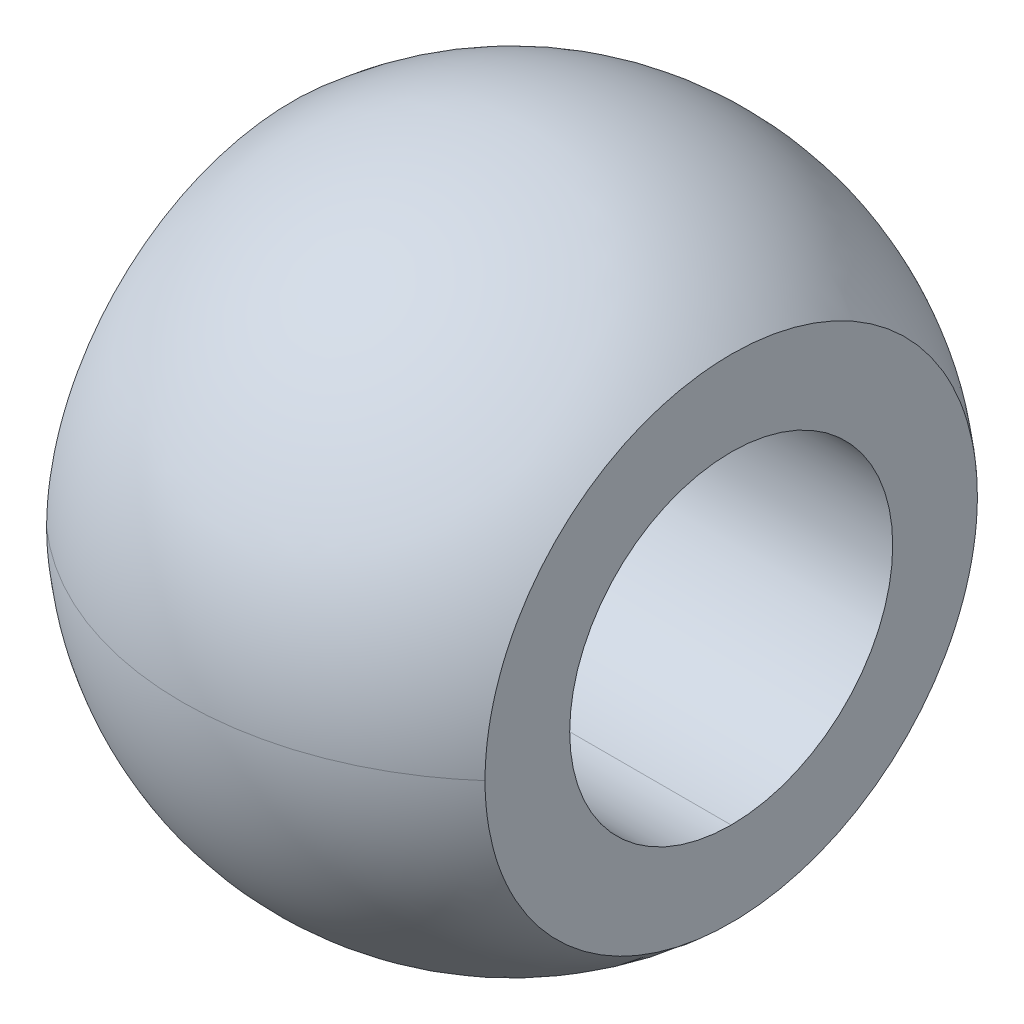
ISO-10303-21;
HEADER;
FILE_DESCRIPTION(('STEP AP214'),'2;1');
FILE_NAME('part.step','',(''),(''),'','','');
FILE_SCHEMA(('AUTOMOTIVE_DESIGN { 1 0 10303 214 1 1 1 1 }'));
ENDSEC;
DATA;
#1=APPLICATION_CONTEXT('core data for automotive mechanical design processes');
#2=APPLICATION_PROTOCOL_DEFINITION('international standard','automotive_design',2000,#1);
#3=PRODUCT_CONTEXT('',#1,'mechanical');
#4=PRODUCT('Part','Part','',(#3));
#5=PRODUCT_RELATED_PRODUCT_CATEGORY('part','',(#4));
#6=PRODUCT_DEFINITION_FORMATION('','',#4);
#7=PRODUCT_DEFINITION_CONTEXT('part definition',#1,'design');
#8=PRODUCT_DEFINITION('design','',#6,#7);
#9=PRODUCT_DEFINITION_SHAPE('','',#8);
#10=(LENGTH_UNIT() NAMED_UNIT(*) SI_UNIT(.MILLI.,.METRE.));
#11=(NAMED_UNIT(*) PLANE_ANGLE_UNIT() SI_UNIT($,.RADIAN.));
#12=(NAMED_UNIT(*) SI_UNIT($,.STERADIAN.) SOLID_ANGLE_UNIT());
#13=UNCERTAINTY_MEASURE_WITH_UNIT(LENGTH_MEASURE(1.E-05),#10,'distance_accuracy_value','');
#14=(GEOMETRIC_REPRESENTATION_CONTEXT(3) GLOBAL_UNCERTAINTY_ASSIGNED_CONTEXT((#13)) GLOBAL_UNIT_ASSIGNED_CONTEXT((#10,
#11,#12)) REPRESENTATION_CONTEXT('',''));
#15=CARTESIAN_POINT('',(0.,0.,0.));
#16=DIRECTION('',(0.,0.,1.));
#17=DIRECTION('',(1.,0.,0.));
#18=AXIS2_PLACEMENT_3D('',#15,#16,#17);
#19=CARTESIAN_POINT('',(0.,0.,0.));
#20=DIRECTION('',(-1.,0.,0.));
#21=DIRECTION('',(0.,0.,1.));
#22=AXIS2_PLACEMENT_3D('',#19,#20,#21);
#23=CYLINDRICAL_SURFACE('',#22,7.);
#24=CARTESIAN_POINT('',(9.5,0.,0.));
#25=DIRECTION('',(-1.,0.,0.));
#26=DIRECTION('',(0.,0.,1.));
#27=AXIS2_PLACEMENT_3D('',#24,#25,#26);
#28=CIRCLE('',#27,7.);
#29=CARTESIAN_POINT('',(9.5,7.,0.));
#30=VERTEX_POINT('',#29);
#31=CARTESIAN_POINT('',(9.5,-7.,0.));
#32=VERTEX_POINT('',#31);
#33=EDGE_CURVE('E68',#30,#32,#28,.F.);
#34=ORIENTED_EDGE('',*,*,#33,.T.);
#35=DIRECTION('',(-1.,0.,0.));
#36=VECTOR('',#35,1.);
#37=CARTESIAN_POINT('',(0.,-7.,0.));
#38=LINE('',#37,#36);
#39=CARTESIAN_POINT('',(-9.5,-7.,0.));
#40=VERTEX_POINT('',#39);
#41=EDGE_CURVE('E63',#32,#40,#38,.T.);
#42=ORIENTED_EDGE('',*,*,#41,.T.);
#43=CARTESIAN_POINT('',(-9.5,0.,0.));
#44=DIRECTION('',(-1.,0.,0.));
#45=DIRECTION('',(0.,0.,1.));
#46=AXIS2_PLACEMENT_3D('',#43,#44,#45);
#47=CIRCLE('',#46,7.);
#48=CARTESIAN_POINT('',(-9.5,7.,0.));
#49=VERTEX_POINT('',#48);
#50=EDGE_CURVE('E65',#40,#49,#47,.T.);
#51=ORIENTED_EDGE('',*,*,#50,.T.);
#52=DIRECTION('',(-1.,0.,0.));
#53=VECTOR('',#52,1.);
#54=CARTESIAN_POINT('',(0.,7.,0.));
#55=LINE('',#54,#53);
#56=EDGE_CURVE('E58',#49,#30,#55,.F.);
#57=ORIENTED_EDGE('',*,*,#56,.T.);
#58=EDGE_LOOP('',(#34,#42,#51,#57));
#59=FACE_BOUND('',#58,.T.);
#60=ADVANCED_FACE('F14',(#59),#23,.F.);
#61=CARTESIAN_POINT('',(0.,0.,0.));
#62=DIRECTION('',(-1.,0.,0.));
#63=DIRECTION('',(0.,0.,1.));
#64=AXIS2_PLACEMENT_3D('',#61,#62,#63);
#65=CYLINDRICAL_SURFACE('',#64,7.);
#66=CARTESIAN_POINT('',(-9.5,0.,0.));
#67=DIRECTION('',(-1.,0.,0.));
#68=DIRECTION('',(0.,0.,1.));
#69=AXIS2_PLACEMENT_3D('',#66,#67,#68);
#70=CIRCLE('',#69,7.);
#71=EDGE_CURVE('E17',#49,#40,#70,.T.);
#72=ORIENTED_EDGE('',*,*,#71,.T.);
#73=ORIENTED_EDGE('',*,*,#41,.F.);
#74=CARTESIAN_POINT('',(9.5,0.,0.));
#75=DIRECTION('',(-1.,0.,0.));
#76=DIRECTION('',(0.,0.,1.));
#77=AXIS2_PLACEMENT_3D('',#74,#75,#76);
#78=CIRCLE('',#77,7.);
#79=EDGE_CURVE('E154',#32,#30,#78,.F.);
#80=ORIENTED_EDGE('',*,*,#79,.T.);
#81=ORIENTED_EDGE('',*,*,#56,.F.);
#82=EDGE_LOOP('',(#72,#73,#80,#81));
#83=FACE_BOUND('',#82,.T.);
#84=ADVANCED_FACE('F71',(#83),#65,.F.);
#85=CARTESIAN_POINT('',(-9.5,28.57,28.57));
#86=DIRECTION('',(1.,0.,0.));
#87=DIRECTION('',(0.,0.,-1.));
#88=AXIS2_PLACEMENT_3D('',#85,#86,#87);
#89=PLANE('',#88);
#90=CARTESIAN_POINT('',(-9.5,0.,10.668234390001));
#91=CARTESIAN_POINT('',(-9.5,-0.300055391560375,10.6682666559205));
#92=CARTESIAN_POINT('',(-9.5,-0.600106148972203,10.6555766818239));
#93=CARTESIAN_POINT('',(-9.5,-1.19806087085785,10.6049852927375));
#94=CARTESIAN_POINT('',(-9.5,-1.49596493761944,10.5670850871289));
#95=CARTESIAN_POINT('',(-9.5,-2.08729445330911,10.4663443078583));
#96=CARTESIAN_POINT('',(-9.5,-2.38072311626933,10.4035226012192));
#97=CARTESIAN_POINT('',(-9.5,-2.96124479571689,10.2533958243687));
#98=CARTESIAN_POINT('',(-9.5,-3.24833788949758,10.1660910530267));
#99=CARTESIAN_POINT('',(-9.5,-3.81429045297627,9.9675668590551));
#100=CARTESIAN_POINT('',(-9.5,-4.09314584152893,9.85633580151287));
#101=CARTESIAN_POINT('',(-9.5,-4.64049407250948,9.61077579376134));
#102=CARTESIAN_POINT('',(-9.5,-4.90898691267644,9.47644683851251));
#103=CARTESIAN_POINT('',(-9.5,-5.43365519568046,9.1856713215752));
#104=CARTESIAN_POINT('',(-9.5,-5.6898327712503,9.02922860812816));
#105=CARTESIAN_POINT('',(-9.5,-6.18809814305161,8.69532095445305));
#106=CARTESIAN_POINT('',(-9.5,-6.43018601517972,8.51785612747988));
#107=CARTESIAN_POINT('',(-9.5,-6.89855039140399,8.14316682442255));
#108=CARTESIAN_POINT('',(-9.5,-7.12482704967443,7.94594254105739));
#109=CARTESIAN_POINT('',(-9.5,-7.5599643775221,7.53313368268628));
#110=CARTESIAN_POINT('',(-9.5,-7.76882495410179,7.31754900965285));
#111=CARTESIAN_POINT('',(-9.5,-8.16768431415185,6.86950749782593));
#112=CARTESIAN_POINT('',(-9.5,-8.35767929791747,6.63704727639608));
#113=CARTESIAN_POINT('',(-9.5,-8.71740589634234,6.15694997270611));
#114=CARTESIAN_POINT('',(-9.5,-8.8871378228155,5.90931312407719));
#115=CARTESIAN_POINT('',(-9.5,-9.205166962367,5.40056784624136));
#116=CARTESIAN_POINT('',(-9.5,-9.35345984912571,5.13945671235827));
#117=CARTESIAN_POINT('',(-9.5,-9.6275155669,4.60566885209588));
#118=CARTESIAN_POINT('',(-9.5,-9.75327830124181,4.33299207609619));
#119=CARTESIAN_POINT('',(-9.5,-9.98132585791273,3.77812983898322));
#120=CARTESIAN_POINT('',(-9.5,-10.083621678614,3.49594890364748));
#121=CARTESIAN_POINT('',(-9.5,-10.264058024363,2.92408463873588));
#122=CARTESIAN_POINT('',(-9.5,-10.342204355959,2.63440313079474));
#123=CARTESIAN_POINT('',(-9.5,-10.494451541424,1.9576995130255));
#124=CARTESIAN_POINT('',(-9.5,-10.5596179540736,1.56860910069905));
#125=CARTESIAN_POINT('',(-9.5,-10.6247801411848,0.981849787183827));
#126=CARTESIAN_POINT('',(-9.5,-10.6410696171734,0.785842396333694));
#127=CARTESIAN_POINT('',(-9.5,-10.6627954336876,0.393239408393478));
#128=CARTESIAN_POINT('',(-9.5,-10.6682324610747,0.196643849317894));
#129=CARTESIAN_POINT('',(-9.5,-10.668234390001,0.));
#130=B_SPLINE_CURVE_WITH_KNOTS('',3,(#90,#91,#92,#93,#94,#95,#96,#97,#98,#99,#100,#101,#102,
#103,#104,#105,#106,#107,#108,#109,#110,#111,#112,#113,#114,#115,#116,#117,#118,#119,#120,#121,
#122,#123,#124,#125,#126,#127,#128,#129),.UNSPECIFIED.,.F.,.F.,(4,2,2,2,2,2,2,2,2,2,2,2,2,2,2,2,
2,2,2,4),(0.,0.899891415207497,1.79973966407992,2.69890797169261,3.59806530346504,
4.49766087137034,5.39725663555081,6.29669604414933,7.19613060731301,8.09555639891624,
8.994986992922,9.89459837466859,10.7941959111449,11.6939747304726,12.5937574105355,
13.4931175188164,14.3922612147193,15.573045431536,16.162842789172,16.7526028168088),.UNSPECIFIED.);
#131=CARTESIAN_POINT('',(-9.5,0.,10.668234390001));
#132=VERTEX_POINT('',#131);
#133=CARTESIAN_POINT('',(-9.5,-10.668234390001,0.));
#134=VERTEX_POINT('',#133);
#135=EDGE_CURVE('E74',#132,#134,#130,.T.);
#136=ORIENTED_EDGE('',*,*,#135,.F.);
#137=CARTESIAN_POINT('',(-9.5,-4.17027523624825E-12,-10.668234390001));
#138=CARTESIAN_POINT('',(-9.5,0.300047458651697,-10.6682666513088));
#139=CARTESIAN_POINT('',(-9.5,0.600090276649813,-10.655577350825));
#140=CARTESIAN_POINT('',(-9.5,1.19802931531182,-10.604988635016));
#141=CARTESIAN_POINT('',(-9.5,1.49592563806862,-10.5670904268));
#142=CARTESIAN_POINT('',(-9.5,2.08725560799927,-10.4663522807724));
#143=CARTESIAN_POINT('',(-9.5,2.3806922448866,-10.4035298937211));
#144=CARTESIAN_POINT('',(-9.5,2.9612296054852,-10.2534004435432));
#145=CARTESIAN_POINT('',(-9.5,3.24833040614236,-10.1660936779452));
#146=CARTESIAN_POINT('',(-9.5,3.81429334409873,-9.96756584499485));
#147=CARTESIAN_POINT('',(-9.5,4.09315153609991,-9.85633353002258));
#148=CARTESIAN_POINT('',(-9.5,4.64050511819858,-9.61077055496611));
#149=CARTESIAN_POINT('',(-9.5,4.90900050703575,-9.4764398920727));
#150=CARTESIAN_POINT('',(-9.5,5.43366816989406,-9.18566354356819));
#151=CARTESIAN_POINT('',(-9.5,5.68984283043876,-9.02922216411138));
#152=CARTESIAN_POINT('',(-9.5,6.18810286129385,-8.69531749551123));
#153=CARTESIAN_POINT('',(-9.5,6.43018829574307,-8.51785430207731));
#154=CARTESIAN_POINT('',(-9.5,6.89855589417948,-8.14316242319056));
#155=CARTESIAN_POINT('',(-9.5,7.12483768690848,-7.94593327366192));
#156=CARTESIAN_POINT('',(-9.5,7.55998365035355,-7.53311457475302));
#157=CARTESIAN_POINT('',(-9.5,7.76884779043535,-7.31752499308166));
#158=CARTESIAN_POINT('',(-9.5,8.1677036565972,-6.86948413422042));
#159=CARTESIAN_POINT('',(-9.5,8.35769251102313,-6.63703030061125));
#160=CARTESIAN_POINT('',(-9.5,8.71741073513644,-6.15694285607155));
#161=CARTESIAN_POINT('',(-9.5,8.88714011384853,-5.90930925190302));
#162=CARTESIAN_POINT('',(-9.5,9.20512563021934,-5.40063417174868));
#163=CARTESIAN_POINT('',(-9.5,9.35338271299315,-5.13959328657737));
#164=CARTESIAN_POINT('',(-9.5,9.62737845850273,-4.60594955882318));
#165=CARTESIAN_POINT('',(-9.5,9.75311711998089,-4.3333467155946));
#166=CARTESIAN_POINT('',(-9.5,9.98117471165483,-3.77853505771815));
#167=CARTESIAN_POINT('',(-9.5,10.0834951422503,-3.49632685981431));
#168=CARTESIAN_POINT('',(-9.5,10.2639991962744,-2.9242941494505));
#169=CARTESIAN_POINT('',(-9.5,10.3421828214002,-2.63446963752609));
#170=CARTESIAN_POINT('',(-9.5,10.4738588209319,-2.04925861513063));
#171=CARTESIAN_POINT('',(-9.5,10.5273506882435,-1.75387199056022));
#172=CARTESIAN_POINT('',(-9.5,10.6092605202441,-1.15964248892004));
#173=CARTESIAN_POINT('',(-9.5,10.6376784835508,-0.860799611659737));
#174=CARTESIAN_POINT('',(-9.5,10.6692388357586,-0.261775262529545));
#175=CARTESIAN_POINT('',(-9.5,10.6723806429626,0.0384062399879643));
#176=CARTESIAN_POINT('',(-9.5,10.6533648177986,0.637966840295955));
#177=CARTESIAN_POINT('',(-9.5,10.6312071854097,0.937345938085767));
#178=CARTESIAN_POINT('',(-9.5,10.5617503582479,1.53317031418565));
#179=CARTESIAN_POINT('',(-9.5,10.5144514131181,1.82961562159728));
#180=CARTESIAN_POINT('',(-9.5,10.3950483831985,2.4174678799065));
#181=CARTESIAN_POINT('',(-9.5,10.3229442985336,2.70887483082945));
#182=CARTESIAN_POINT('',(-9.5,10.1544438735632,3.2845777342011));
#183=CARTESIAN_POINT('',(-9.5,10.0580476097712,3.56887370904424));
#184=CARTESIAN_POINT('',(-9.5,9.84164803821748,4.12833442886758));
#185=CARTESIAN_POINT('',(-9.5,9.72164473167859,4.40349917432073));
#186=CARTESIAN_POINT('',(-9.5,9.45888078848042,4.94274824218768));
#187=CARTESIAN_POINT('',(-9.5,9.31611955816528,5.20683227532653));
#188=CARTESIAN_POINT('',(-9.5,9.00885694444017,5.72203482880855));
#189=CARTESIAN_POINT('',(-9.5,8.84435555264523,5.97315334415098));
#190=CARTESIAN_POINT('',(-9.5,8.49479072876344,6.46062750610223));
#191=CARTESIAN_POINT('',(-9.5,8.30972829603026,6.69698386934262));
#192=CARTESIAN_POINT('',(-9.5,7.9203508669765,7.15326632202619));
#193=CARTESIAN_POINT('',(-9.5,7.71603590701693,7.37319244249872));
#194=CARTESIAN_POINT('',(-9.5,7.28963493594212,7.79502243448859));
#195=CARTESIAN_POINT('',(-9.5,7.06755136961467,7.99692877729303));
#196=CARTESIAN_POINT('',(-9.5,6.60716540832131,8.38131963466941));
#197=CARTESIAN_POINT('',(-9.5,6.36886289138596,8.56380400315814));
#198=CARTESIAN_POINT('',(-9.5,5.87765308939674,8.90810906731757));
#199=CARTESIAN_POINT('',(-9.5,5.62474101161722,9.06992292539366));
#200=CARTESIAN_POINT('',(-9.5,5.10619007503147,9.37166100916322));
#201=CARTESIAN_POINT('',(-9.5,4.8405516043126,9.51158590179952));
#202=CARTESIAN_POINT('',(-9.5,4.29826031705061,9.76863755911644));
#203=CARTESIAN_POINT('',(-9.5,4.0216006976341,9.88574997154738));
#204=CARTESIAN_POINT('',(-9.5,3.45939257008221,10.0962329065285));
#205=CARTESIAN_POINT('',(-9.5,3.17384411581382,10.1896035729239));
#206=CARTESIAN_POINT('',(-9.5,2.59627198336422,10.3518340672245));
#207=CARTESIAN_POINT('',(-9.5,2.30425710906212,10.4207252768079));
#208=CARTESIAN_POINT('',(-9.5,1.71557944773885,10.5336493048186));
#209=CARTESIAN_POINT('',(-9.5,1.41891901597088,10.577694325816));
#210=CARTESIAN_POINT('',(-9.5,0.934677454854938,10.6288626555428));
#211=CARTESIAN_POINT('',(-9.5,0.747871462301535,10.6436364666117));
#212=CARTESIAN_POINT('',(-9.5,0.374050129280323,10.66331526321));
#213=CARTESIAN_POINT('',(-9.5,0.187035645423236,10.6682365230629));
#214=CARTESIAN_POINT('',(-9.5,0.,10.668234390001));
#215=B_SPLINE_CURVE_WITH_KNOTS('',3,(#137,#138,#139,#140,#141,#142,#143,#144,#145,#146,#147,
#148,#149,#150,#151,#152,#153,#154,#155,#156,#157,#158,#159,#160,#161,#162,#163,#164,#165,#166,
#167,#168,#169,#170,#171,#172,#173,#174,#175,#176,#177,#178,#179,#180,#181,#182,#183,#184,#185,
#186,#187,#188,#189,#190,#191,#192,#193,#194,#195,#196,#197,#198,#199,#200,#201,#202,#203,#204,
#205,#206,#207,#208,#209,#210,#211,#212,#213,#214),.UNSPECIFIED.,.F.,.F.,(4,2,2,2,2,2,2,2,2,2,2,
2,2,2,2,2,2,2,2,2,2,2,2,2,2,2,2,2,2,2,2,2,2,2,2,2,2,2,4),(0.,0.899867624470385,1.79969216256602,
2.6988841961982,3.59806530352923,4.49767005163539,5.39727490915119,6.2967048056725,
7.19613060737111,8.0955775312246,8.9950260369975,9.89461117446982,10.794195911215,
11.6937410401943,12.5932862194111,13.4927737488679,14.3922612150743,15.2917671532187,
16.1912731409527,17.0907998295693,17.9903265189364,18.8898442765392,19.7893620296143,
20.6888769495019,21.588391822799,22.4879301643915,23.3874688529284,24.2869638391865,
25.1864571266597,26.0858268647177,26.9852033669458,27.8848766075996,28.7845224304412,
29.684732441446,30.5849369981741,31.4839833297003,32.382587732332,32.944516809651,
33.5055169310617),.UNSPECIFIED.);
#216=CARTESIAN_POINT('',(-9.5,-4.1737446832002E-12,-10.668234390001));
#217=VERTEX_POINT('',#216);
#218=EDGE_CURVE('E151',#217,#132,#215,.T.);
#219=ORIENTED_EDGE('',*,*,#218,.F.);
#220=CARTESIAN_POINT('',(-9.5,-10.668234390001,0.));
#221=CARTESIAN_POINT('',(-9.5,-10.6682666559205,-0.300055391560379));
#222=CARTESIAN_POINT('',(-9.5,-10.6555766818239,-0.600106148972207));
#223=CARTESIAN_POINT('',(-9.5,-10.6049852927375,-1.19806087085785));
#224=CARTESIAN_POINT('',(-9.5,-10.5670850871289,-1.49596493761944));
#225=CARTESIAN_POINT('',(-9.5,-10.4663443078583,-2.08729445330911));
#226=CARTESIAN_POINT('',(-9.5,-10.4035226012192,-2.38072311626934));
#227=CARTESIAN_POINT('',(-9.5,-10.2533958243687,-2.96124479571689));
#228=CARTESIAN_POINT('',(-9.5,-10.1660910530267,-3.24833788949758));
#229=CARTESIAN_POINT('',(-9.5,-9.96756685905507,-3.81429045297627));
#230=CARTESIAN_POINT('',(-9.5,-9.85633580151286,-4.09314584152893));
#231=CARTESIAN_POINT('',(-9.5,-9.61077579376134,-4.64049407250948));
#232=CARTESIAN_POINT('',(-9.5,-9.4764468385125,-4.90898691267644));
#233=CARTESIAN_POINT('',(-9.5,-9.18567132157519,-5.43365519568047));
#234=CARTESIAN_POINT('',(-9.5,-9.02922860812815,-5.68983277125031));
#235=CARTESIAN_POINT('',(-9.5,-8.69532095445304,-6.18809814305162));
#236=CARTESIAN_POINT('',(-9.5,-8.51785612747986,-6.43018601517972));
#237=CARTESIAN_POINT('',(-9.5,-8.14316682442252,-6.89855039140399));
#238=CARTESIAN_POINT('',(-9.5,-7.94594254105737,-7.12482704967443));
#239=CARTESIAN_POINT('',(-9.5,-7.53313368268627,-7.5599643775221));
#240=CARTESIAN_POINT('',(-9.5,-7.31754900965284,-7.76882495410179));
#241=CARTESIAN_POINT('',(-9.5,-6.86950749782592,-8.16768431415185));
#242=CARTESIAN_POINT('',(-9.5,-6.63704727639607,-8.35767929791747));
#243=CARTESIAN_POINT('',(-9.5,-6.15694997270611,-8.71740589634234));
#244=CARTESIAN_POINT('',(-9.5,-5.90931312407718,-8.88713782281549));
#245=CARTESIAN_POINT('',(-9.5,-5.40056784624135,-9.205166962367));
#246=CARTESIAN_POINT('',(-9.5,-5.13945671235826,-9.3534598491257));
#247=CARTESIAN_POINT('',(-9.5,-4.60566885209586,-9.6275155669));
#248=CARTESIAN_POINT('',(-9.5,-4.33299207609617,-9.75327830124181));
#249=CARTESIAN_POINT('',(-9.5,-3.7781298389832,-9.98132585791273));
#250=CARTESIAN_POINT('',(-9.5,-3.49594890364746,-10.083621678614));
#251=CARTESIAN_POINT('',(-9.5,-2.92408463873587,-10.264058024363));
#252=CARTESIAN_POINT('',(-9.5,-2.63440313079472,-10.342204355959));
#253=CARTESIAN_POINT('',(-9.5,-1.95769951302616,-10.4944515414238));
#254=CARTESIAN_POINT('',(-9.5,-1.56860910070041,-10.5596179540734));
#255=CARTESIAN_POINT('',(-9.5,-0.981849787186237,-10.6247801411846));
#256=CARTESIAN_POINT('',(-9.5,-0.785842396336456,-10.6410696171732));
#257=CARTESIAN_POINT('',(-9.5,-0.393239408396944,-10.6627954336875));
#258=CARTESIAN_POINT('',(-9.5,-0.19664384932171,-10.6682324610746));
#259=CARTESIAN_POINT('',(-9.5,-4.17027523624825E-12,-10.668234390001));
#260=B_SPLINE_CURVE_WITH_KNOTS('',3,(#220,#221,#222,#223,#224,#225,#226,#227,#228,#229,#230,
#231,#232,#233,#234,#235,#236,#237,#238,#239,#240,#241,#242,#243,#244,#245,#246,#247,#248,#249,
#250,#251,#252,#253,#254,#255,#256,#257,#258,#259),.UNSPECIFIED.,.F.,.F.,(4,2,2,2,2,2,2,2,2,2,2,
2,2,2,2,2,2,2,2,4),(0.,0.899891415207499,1.79973966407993,2.69890797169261,3.59806530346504,
4.49766087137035,5.39725663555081,6.29669604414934,7.19613060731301,8.09555639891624,
8.99498699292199,9.89459837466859,10.7941959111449,11.6939747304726,12.5937574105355,
13.4931175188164,14.3922612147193,15.573045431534,16.1628427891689,16.7526028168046),.UNSPECIFIED.);
#261=EDGE_CURVE('E76',#134,#217,#260,.T.);
#262=ORIENTED_EDGE('',*,*,#261,.F.);
#263=EDGE_LOOP('',(#136,#219,#262));
#264=FACE_BOUND('',#263,.T.);
#265=ORIENTED_EDGE('',*,*,#71,.F.);
#266=ORIENTED_EDGE('',*,*,#50,.F.);
#267=EDGE_LOOP('',(#265,#266));
#268=FACE_BOUND('',#267,.T.);
#269=ADVANCED_FACE('F73',(#264,#268),#89,.F.);
#270=CARTESIAN_POINT('',(0.,0.,0.));
#271=DIRECTION('',(0.,0.,-1.));
#272=DIRECTION('',(0.,1.,0.));
#273=AXIS2_PLACEMENT_3D('',#270,#271,#272);
#274=SPHERICAL_SURFACE('',#273,14.285);
#275=ORIENTED_EDGE('',*,*,#135,.T.);
#276=ORIENTED_EDGE('',*,*,#261,.T.);
#277=CARTESIAN_POINT('',(0.,0.,-14.285));
#278=CARTESIAN_POINT('',(-0.216518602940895,-5.71576625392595E-13,-14.2850036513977));
#279=CARTESIAN_POINT('',(-0.433036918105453,-1.14315249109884E-12,-14.2800774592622));
#280=CARTESIAN_POINT('',(-0.86562610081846,-2.28512302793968E-12,-14.2603916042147));
#281=CARTESIAN_POINT('',(-1.08169696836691,-2.85551769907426E-12,-14.2456319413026));
#282=CARTESIAN_POINT('',(-1.51294438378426,-3.99394617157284E-12,-14.206305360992));
#283=CARTESIAN_POINT('',(-1.72812093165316,-4.56197997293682E-12,-14.1817384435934));
#284=CARTESIAN_POINT('',(-2.15713493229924,-5.69451256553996E-12,-14.1228492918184));
#285=CARTESIAN_POINT('',(-2.37097238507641,-6.25901135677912E-12,-14.088527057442));
#286=CARTESIAN_POINT('',(-2.79686612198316,-7.38330692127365E-12,-14.0101979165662));
#287=CARTESIAN_POINT('',(-3.00892240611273,-7.94310369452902E-12,-13.9661910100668));
#288=CARTESIAN_POINT('',(-3.43081543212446,-9.05683798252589E-12,-13.8685835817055));
#289=CARTESIAN_POINT('',(-3.64065217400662,-9.61077549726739E-12,-13.8149830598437));
#290=CARTESIAN_POINT('',(-4.05767232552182,-1.07116461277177E-11,-13.6982991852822));
#291=CARTESIAN_POINT('',(-4.26485573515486,-1.12585792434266E-11,-13.6352158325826));
#292=CARTESIAN_POINT('',(-4.67614091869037,-1.2344310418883E-11,-13.4996967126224));
#293=CARTESIAN_POINT('',(-4.88024269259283,-1.28831084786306E-11,-13.4272609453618));
#294=CARTESIAN_POINT('',(-5.28494267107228,-1.39514557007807E-11,-13.273186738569));
#295=CARTESIAN_POINT('',(-5.48554087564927,-1.44810048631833E-11,-13.1915482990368));
#296=CARTESIAN_POINT('',(-5.88281902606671,-1.55297595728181E-11,-13.019237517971));
#297=CARTESIAN_POINT('',(-6.07949897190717,-1.60489651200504E-11,-12.9285651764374));
#298=CARTESIAN_POINT('',(-6.46853401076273,-1.70759592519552E-11,-12.7383740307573));
#299=CARTESIAN_POINT('',(-6.66088910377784,-1.75837478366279E-11,-12.6388552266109));
#300=CARTESIAN_POINT('',(-7.04087680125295,-1.85868583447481E-11,-12.4311769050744));
#301=CARTESIAN_POINT('',(-7.22850940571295,-1.90821802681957E-11,-12.3230173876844));
#302=CARTESIAN_POINT('',(-7.59866418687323,-2.00593333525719E-11,-12.0982811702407));
#303=CARTESIAN_POINT('',(-7.7811863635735,-2.05411645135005E-11,-11.981704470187));
#304=CARTESIAN_POINT('',(-8.14074316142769,-2.14903405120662E-11,-11.7403751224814));
#305=CARTESIAN_POINT('',(-8.3177777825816,-2.19576853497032E-11,-11.6156224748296));
#306=CARTESIAN_POINT('',(-8.66599276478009,-2.28769206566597E-11,-11.3581982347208));
#307=CARTESIAN_POINT('',(-8.83717312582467,-2.33288111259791E-11,-11.2255266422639));
#308=CARTESIAN_POINT('',(-9.17332842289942,-2.42162106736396E-11,-10.9525421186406));
#309=CARTESIAN_POINT('',(-9.33830335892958,-2.46517197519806E-11,-10.8122291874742));
#310=CARTESIAN_POINT('',(-9.5,-2.50785746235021E-11,-10.668234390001));
#311=B_SPLINE_CURVE_WITH_KNOTS('',3,(#277,#278,#279,#280,#281,#282,#283,#284,#285,#286,#287,
#288,#289,#290,#291,#292,#293,#294,#295,#296,#297,#298,#299,#300,#301,#302,#303,#304,#305,#306,
#307,#308,#309,#310),.UNSPECIFIED.,.F.,.F.,(4,2,2,2,2,2,2,2,2,2,2,2,2,2,2,2,4),(0.,
0.649499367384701,1.2989987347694,1.9484981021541,2.5979974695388,3.2474968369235,
3.89699620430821,4.54649557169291,5.19599493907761,5.84549430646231,6.49499367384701,
7.14449304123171,7.79399240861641,8.44349177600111,9.09299114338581,9.74249051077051,
10.3919898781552),.UNSPECIFIED.);
#312=CARTESIAN_POINT('',(0.,0.,-14.285));
#313=VERTEX_POINT('',#312);
#314=EDGE_CURVE('E145',#313,#217,#311,.T.);
#315=ORIENTED_EDGE('',*,*,#314,.F.);
#316=CARTESIAN_POINT('',(0.,0.,0.));
#317=DIRECTION('',(-2.63516414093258E-12,-1.,0.));
#318=DIRECTION('',(0.,0.,-1.));
#319=AXIS2_PLACEMENT_3D('',#316,#317,#318);
#320=CIRCLE('',#319,14.285);
#321=CARTESIAN_POINT('',(9.5,-1.46039020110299E-11,-10.668234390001));
#322=VERTEX_POINT('',#321);
#323=EDGE_CURVE('E147',#322,#313,#320,.F.);
#324=ORIENTED_EDGE('',*,*,#323,.F.);
#325=CARTESIAN_POINT('',(9.5,-4.1737446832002E-12,-10.668234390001));
#326=CARTESIAN_POINT('',(9.5,-0.300047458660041,-10.6682666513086));
#327=CARTESIAN_POINT('',(9.5,-0.600090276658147,-10.6555773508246));
#328=CARTESIAN_POINT('',(9.5,-1.19802931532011,-10.604988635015));
#329=CARTESIAN_POINT('',(9.5,-1.49592563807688,-10.5670904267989));
#330=CARTESIAN_POINT('',(9.5,-2.08725560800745,-10.4663522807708));
#331=CARTESIAN_POINT('',(9.5,-2.38069224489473,-10.4035298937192));
#332=CARTESIAN_POINT('',(9.5,-2.96122960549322,-10.2534004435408));
#333=CARTESIAN_POINT('',(9.5,-3.24833040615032,-10.1660936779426));
#334=CARTESIAN_POINT('',(9.5,-3.81429334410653,-9.96756584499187));
#335=CARTESIAN_POINT('',(9.5,-4.09315153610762,-9.85633353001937));
#336=CARTESIAN_POINT('',(9.5,-4.6405051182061,-9.61077055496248));
#337=CARTESIAN_POINT('',(9.5,-4.90900050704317,-9.47643989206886));
#338=CARTESIAN_POINT('',(9.5,-5.43366816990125,-9.18566354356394));
#339=CARTESIAN_POINT('',(9.5,-5.68984283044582,-9.02922216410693));
#340=CARTESIAN_POINT('',(9.5,-6.18810286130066,-8.69531749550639));
#341=CARTESIAN_POINT('',(9.5,-6.43018829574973,-8.51785430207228));
#342=CARTESIAN_POINT('',(9.5,-6.89855589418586,-8.14316242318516));
#343=CARTESIAN_POINT('',(9.5,-7.1248376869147,-7.94593327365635));
#344=CARTESIAN_POINT('',(9.5,-7.55998365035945,-7.5331145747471));
#345=CARTESIAN_POINT('',(9.5,-7.76884779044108,-7.31752499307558));
#346=CARTESIAN_POINT('',(9.5,-8.16770365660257,-6.86948413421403));
#347=CARTESIAN_POINT('',(9.5,-8.35769251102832,-6.63703030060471));
#348=CARTESIAN_POINT('',(9.5,-8.71741073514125,-6.15694285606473));
#349=CARTESIAN_POINT('',(9.5,-8.88714011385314,-5.90930925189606));
#350=CARTESIAN_POINT('',(9.5,-9.20512563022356,-5.40063417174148));
#351=CARTESIAN_POINT('',(9.5,-9.35338271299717,-5.13959328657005));
#352=CARTESIAN_POINT('',(9.5,-9.62737845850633,-4.60594955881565));
#353=CARTESIAN_POINT('',(9.5,-9.75311711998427,-4.33334671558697));
#354=CARTESIAN_POINT('',(9.5,-9.98117471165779,-3.77853505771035));
#355=CARTESIAN_POINT('',(9.5,-10.0834951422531,-3.49632685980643));
#356=CARTESIAN_POINT('',(9.5,-10.2639991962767,-2.92429414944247));
#357=CARTESIAN_POINT('',(9.5,-10.3421828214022,-2.634469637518));
#358=CARTESIAN_POINT('',(9.5,-10.4738588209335,-2.04925861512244));
#359=CARTESIAN_POINT('',(9.5,-10.5273506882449,-1.75387199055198));
#360=CARTESIAN_POINT('',(9.5,-10.609260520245,-1.15964248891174));
#361=CARTESIAN_POINT('',(9.5,-10.6376784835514,-0.860799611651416));
#362=CARTESIAN_POINT('',(9.5,-10.6692388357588,-0.261775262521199));
#363=CARTESIAN_POINT('',(9.5,-10.6723806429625,0.0384062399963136));
#364=CARTESIAN_POINT('',(9.5,-10.6533648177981,0.637966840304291));
#365=CARTESIAN_POINT('',(9.5,-10.6312071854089,0.937345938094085));
#366=CARTESIAN_POINT('',(9.5,-10.5617503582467,1.53317031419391));
#367=CARTESIAN_POINT('',(9.5,-10.5144514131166,1.82961562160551));
#368=CARTESIAN_POINT('',(9.5,-10.3950483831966,2.41746787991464));
#369=CARTESIAN_POINT('',(9.5,-10.3229442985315,2.70887483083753));
#370=CARTESIAN_POINT('',(9.5,-10.1544438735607,3.28457773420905));
#371=CARTESIAN_POINT('',(9.5,-10.0580476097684,3.56887370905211));
#372=CARTESIAN_POINT('',(9.5,-9.84164803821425,4.12833442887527));
#373=CARTESIAN_POINT('',(9.5,-9.72164473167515,4.40349917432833));
#374=CARTESIAN_POINT('',(9.5,-9.45888078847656,4.94274824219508));
#375=CARTESIAN_POINT('',(9.5,-9.31611955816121,5.20683227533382));
#376=CARTESIAN_POINT('',(9.5,-9.0088569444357,5.72203482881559));
#377=CARTESIAN_POINT('',(9.5,-8.84435555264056,5.9731533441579));
#378=CARTESIAN_POINT('',(9.5,-8.49479072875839,6.46062750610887));
#379=CARTESIAN_POINT('',(9.5,-8.30972829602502,6.69698386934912));
#380=CARTESIAN_POINT('',(9.5,-7.9203508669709,7.15326632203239));
#381=CARTESIAN_POINT('',(9.5,-7.71603590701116,7.37319244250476));
#382=CARTESIAN_POINT('',(9.5,-7.28963493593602,7.7950224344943));
#383=CARTESIAN_POINT('',(9.5,-7.06755136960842,7.99692877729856));
#384=CARTESIAN_POINT('',(9.5,-6.60716540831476,8.38131963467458));
#385=CARTESIAN_POINT('',(9.5,-6.36886289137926,8.56380400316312));
#386=CARTESIAN_POINT('',(9.5,-5.87765308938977,8.90810906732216));
#387=CARTESIAN_POINT('',(9.5,-5.62474101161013,9.06992292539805));
#388=CARTESIAN_POINT('',(9.5,-5.10619007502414,9.37166100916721));
#389=CARTESIAN_POINT('',(9.5,-4.84055160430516,9.51158590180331));
#390=CARTESIAN_POINT('',(9.5,-4.29826031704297,9.76863755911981));
#391=CARTESIAN_POINT('',(9.5,-4.02160069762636,9.88574997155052));
#392=CARTESIAN_POINT('',(9.5,-3.4593925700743,10.0962329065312));
#393=CARTESIAN_POINT('',(9.5,-3.17384411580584,10.1896035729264));
#394=CARTESIAN_POINT('',(9.5,-2.59627198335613,10.3518340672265));
#395=CARTESIAN_POINT('',(9.5,-2.30425710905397,10.4207252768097));
#396=CARTESIAN_POINT('',(9.5,-1.71557944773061,10.5336493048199));
#397=CARTESIAN_POINT('',(9.5,-1.41891901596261,10.5776943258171));
#398=CARTESIAN_POINT('',(9.5,-0.934677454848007,10.6288626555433));
#399=CARTESIAN_POINT('',(9.5,-0.747871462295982,10.643636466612));
#400=CARTESIAN_POINT('',(9.5,-0.374050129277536,10.6633152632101));
#401=CARTESIAN_POINT('',(9.5,-0.187035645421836,10.6682365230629));
#402=CARTESIAN_POINT('',(9.5,0.,10.668234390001));
#403=B_SPLINE_CURVE_WITH_KNOTS('',3,(#325,#326,#327,#328,#329,#330,#331,#332,#333,#334,#335,
#336,#337,#338,#339,#340,#341,#342,#343,#344,#345,#346,#347,#348,#349,#350,#351,#352,#353,#354,
#355,#356,#357,#358,#359,#360,#361,#362,#363,#364,#365,#366,#367,#368,#369,#370,#371,#372,#373,
#374,#375,#376,#377,#378,#379,#380,#381,#382,#383,#384,#385,#386,#387,#388,#389,#390,#391,#392,
#393,#394,#395,#396,#397,#398,#399,#400,#401,#402),.UNSPECIFIED.,.F.,.F.,(4,2,2,2,2,2,2,2,2,2,2,
2,2,2,2,2,2,2,2,2,2,2,2,2,2,2,2,2,2,2,2,2,2,2,2,2,2,2,4),(0.,0.899867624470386,1.79969216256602,
2.6988841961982,3.59806530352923,4.49767005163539,5.39727490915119,6.2967048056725,
7.19613060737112,8.0955775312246,8.9950260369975,9.89461117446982,10.794195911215,
11.6937410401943,12.5932862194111,13.4927737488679,14.3922612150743,15.2917671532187,
16.1912731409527,17.0907998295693,17.9903265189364,18.8898442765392,19.7893620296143,
20.6888769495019,21.588391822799,22.4879301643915,23.3874688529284,24.2869638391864,
25.1864571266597,26.0858268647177,26.9852033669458,27.8848766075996,28.7845224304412,
29.684732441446,30.5849369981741,31.4839833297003,32.382587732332,32.9445168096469,
33.5055169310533),.UNSPECIFIED.);
#404=CARTESIAN_POINT('',(9.5,0.,10.668234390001));
#405=VERTEX_POINT('',#404);
#406=EDGE_CURVE('E152',#322,#405,#403,.T.);
#407=ORIENTED_EDGE('',*,*,#406,.T.);
#408=CARTESIAN_POINT('',(0.,0.,14.285));
#409=CARTESIAN_POINT('',(0.216518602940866,0.,14.2850036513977));
#410=CARTESIAN_POINT('',(0.433036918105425,0.,14.2800774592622));
#411=CARTESIAN_POINT('',(0.865626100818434,0.,14.2603916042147));
#412=CARTESIAN_POINT('',(1.08169696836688,0.,14.2456319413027));
#413=CARTESIAN_POINT('',(1.51294438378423,0.,14.206305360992));
#414=CARTESIAN_POINT('',(1.72812093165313,0.,14.1817384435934));
#415=CARTESIAN_POINT('',(2.15713493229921,0.,14.1228492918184));
#416=CARTESIAN_POINT('',(2.37097238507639,0.,14.088527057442));
#417=CARTESIAN_POINT('',(2.79686612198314,0.,14.0101979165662));
#418=CARTESIAN_POINT('',(3.00892240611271,0.,13.9661910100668));
#419=CARTESIAN_POINT('',(3.43081543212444,0.,13.8685835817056));
#420=CARTESIAN_POINT('',(3.6406521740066,0.,13.8149830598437));
#421=CARTESIAN_POINT('',(4.0576723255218,0.,13.6982991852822));
#422=CARTESIAN_POINT('',(4.26485573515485,0.,13.6352158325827));
#423=CARTESIAN_POINT('',(4.67614091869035,0.,13.4996967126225));
#424=CARTESIAN_POINT('',(4.88024269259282,0.,13.4272609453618));
#425=CARTESIAN_POINT('',(5.28494267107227,0.,13.273186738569));
#426=CARTESIAN_POINT('',(5.48554087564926,0.,13.1915482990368));
#427=CARTESIAN_POINT('',(5.8828190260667,0.,13.019237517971));
#428=CARTESIAN_POINT('',(6.07949897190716,0.,12.9285651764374));
#429=CARTESIAN_POINT('',(6.46853401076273,0.,12.7383740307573));
#430=CARTESIAN_POINT('',(6.66088910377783,0.,12.6388552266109));
#431=CARTESIAN_POINT('',(7.04087680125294,0.,12.4311769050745));
#432=CARTESIAN_POINT('',(7.22850940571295,0.,12.3230173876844));
#433=CARTESIAN_POINT('',(7.59866418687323,0.,12.0982811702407));
#434=CARTESIAN_POINT('',(7.7811863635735,0.,11.981704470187));
#435=CARTESIAN_POINT('',(8.14074316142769,0.,11.7403751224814));
#436=CARTESIAN_POINT('',(8.3177777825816,0.,11.6156224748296));
#437=CARTESIAN_POINT('',(8.66599276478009,0.,11.3581982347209));
#438=CARTESIAN_POINT('',(8.83717312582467,0.,11.2255266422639));
#439=CARTESIAN_POINT('',(9.17332842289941,0.,10.9525421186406));
#440=CARTESIAN_POINT('',(9.33830335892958,0.,10.8122291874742));
#441=CARTESIAN_POINT('',(9.5,0.,10.668234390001));
#442=B_SPLINE_CURVE_WITH_KNOTS('',3,(#408,#409,#410,#411,#412,#413,#414,#415,#416,#417,#418,
#419,#420,#421,#422,#423,#424,#425,#426,#427,#428,#429,#430,#431,#432,#433,#434,#435,#436,#437,
#438,#439,#440,#441),.UNSPECIFIED.,.F.,.F.,(4,2,2,2,2,2,2,2,2,2,2,2,2,2,2,2,4),(0.,
0.649499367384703,1.29899873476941,1.9484981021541,2.59799746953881,3.24749683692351,
3.89699620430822,4.54649557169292,5.19599493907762,5.84549430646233,6.49499367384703,
7.14449304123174,7.79399240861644,8.44349177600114,9.09299114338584,9.74249051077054,
10.3919898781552),.UNSPECIFIED.);
#443=CARTESIAN_POINT('',(0.,0.,14.285));
#444=VERTEX_POINT('',#443);
#445=EDGE_CURVE('E113',#444,#405,#442,.T.);
#446=ORIENTED_EDGE('',*,*,#445,.F.);
#447=CARTESIAN_POINT('',(0.,0.,0.));
#448=DIRECTION('',(0.,1.,0.));
#449=DIRECTION('',(0.,0.,-1.));
#450=AXIS2_PLACEMENT_3D('',#447,#448,#449);
#451=CIRCLE('',#450,14.285);
#452=EDGE_CURVE('E179',#132,#444,#451,.T.);
#453=ORIENTED_EDGE('',*,*,#452,.F.);
#454=EDGE_LOOP('',(#275,#276,#315,#324,#407,#446,#453));
#455=FACE_BOUND('',#454,.T.);
#456=ADVANCED_FACE('F92',(#455),#274,.T.);
#457=CARTESIAN_POINT('',(9.5,28.57,-28.57));
#458=DIRECTION('',(-1.,0.,0.));
#459=DIRECTION('',(0.,0.,1.));
#460=AXIS2_PLACEMENT_3D('',#457,#458,#459);
#461=PLANE('',#460);
#462=CARTESIAN_POINT('',(9.5,0.,10.668234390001));
#463=CARTESIAN_POINT('',(9.5,0.300055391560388,10.6682666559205));
#464=CARTESIAN_POINT('',(9.5,0.600106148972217,10.6555766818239));
#465=CARTESIAN_POINT('',(9.5,1.19806087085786,10.6049852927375));
#466=CARTESIAN_POINT('',(9.5,1.49596493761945,10.5670850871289));
#467=CARTESIAN_POINT('',(9.5,2.08729445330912,10.4663443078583));
#468=CARTESIAN_POINT('',(9.5,2.38072311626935,10.4035226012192));
#469=CARTESIAN_POINT('',(9.5,2.96124479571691,10.2533958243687));
#470=CARTESIAN_POINT('',(9.5,3.24833788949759,10.1660910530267));
#471=CARTESIAN_POINT('',(9.5,3.81429045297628,9.96756685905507));
#472=CARTESIAN_POINT('',(9.5,4.09314584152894,9.85633580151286));
#473=CARTESIAN_POINT('',(9.5,4.6404940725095,9.61077579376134));
#474=CARTESIAN_POINT('',(9.5,4.90898691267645,9.4764468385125));
#475=CARTESIAN_POINT('',(9.5,5.43365519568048,9.18567132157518));
#476=CARTESIAN_POINT('',(9.5,5.68983277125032,9.02922860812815));
#477=CARTESIAN_POINT('',(9.5,6.18809814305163,8.69532095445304));
#478=CARTESIAN_POINT('',(9.5,6.43018601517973,8.51785612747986));
#479=CARTESIAN_POINT('',(9.5,6.898550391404,8.14316682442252));
#480=CARTESIAN_POINT('',(9.5,7.12482704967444,7.94594254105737));
#481=CARTESIAN_POINT('',(9.5,7.55996437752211,7.53313368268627));
#482=CARTESIAN_POINT('',(9.5,7.7688249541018,7.31754900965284));
#483=CARTESIAN_POINT('',(9.5,8.16768431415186,6.86950749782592));
#484=CARTESIAN_POINT('',(9.5,8.35767929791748,6.63704727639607));
#485=CARTESIAN_POINT('',(9.5,8.71740589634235,6.15694997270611));
#486=CARTESIAN_POINT('',(9.5,8.8871378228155,5.90931312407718));
#487=CARTESIAN_POINT('',(9.5,9.205166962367,5.40056784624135));
#488=CARTESIAN_POINT('',(9.5,9.35345984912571,5.13945671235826));
#489=CARTESIAN_POINT('',(9.5,9.62751556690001,4.60566885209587));
#490=CARTESIAN_POINT('',(9.5,9.75327830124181,4.33299207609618));
#491=CARTESIAN_POINT('',(9.5,9.98132585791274,3.77812983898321));
#492=CARTESIAN_POINT('',(9.5,10.083621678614,3.49594890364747));
#493=CARTESIAN_POINT('',(9.5,10.264058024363,2.92408463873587));
#494=CARTESIAN_POINT('',(9.5,10.342204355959,2.63440313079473));
#495=CARTESIAN_POINT('',(9.5,10.494451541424,1.95769951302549));
#496=CARTESIAN_POINT('',(9.5,10.5596179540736,1.56860910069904));
#497=CARTESIAN_POINT('',(9.5,10.6247801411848,0.981849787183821));
#498=CARTESIAN_POINT('',(9.5,10.6410696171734,0.785842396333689));
#499=CARTESIAN_POINT('',(9.5,10.6627954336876,0.393239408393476));
#500=CARTESIAN_POINT('',(9.5,10.6682324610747,0.196643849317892));
#501=CARTESIAN_POINT('',(9.5,10.668234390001,0.));
#502=B_SPLINE_CURVE_WITH_KNOTS('',3,(#462,#463,#464,#465,#466,#467,#468,#469,#470,#471,#472,
#473,#474,#475,#476,#477,#478,#479,#480,#481,#482,#483,#484,#485,#486,#487,#488,#489,#490,#491,
#492,#493,#494,#495,#496,#497,#498,#499,#500,#501),.UNSPECIFIED.,.F.,.F.,(4,2,2,2,2,2,2,2,2,2,2,
2,2,2,2,2,2,2,2,4),(0.,0.8998914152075,1.79973966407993,2.69890797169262,3.59806530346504,
4.49766087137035,5.39725663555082,6.29669604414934,7.19613060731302,8.09555639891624,
8.994986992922,9.89459837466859,10.7941959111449,11.6939747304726,12.5937574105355,
13.4931175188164,14.3922612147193,15.573045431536,16.162842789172,16.7526028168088),.UNSPECIFIED.);
#503=CARTESIAN_POINT('',(9.5,10.668234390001,0.));
#504=VERTEX_POINT('',#503);
#505=EDGE_CURVE('E23',#405,#504,#502,.T.);
#506=ORIENTED_EDGE('',*,*,#505,.F.);
#507=ORIENTED_EDGE('',*,*,#406,.F.);
#508=CARTESIAN_POINT('',(9.5,10.668234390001,0.));
#509=CARTESIAN_POINT('',(9.5,10.6682666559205,-0.300055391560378));
#510=CARTESIAN_POINT('',(9.5,10.6555766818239,-0.600106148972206));
#511=CARTESIAN_POINT('',(9.5,10.6049852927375,-1.19806087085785));
#512=CARTESIAN_POINT('',(9.5,10.5670850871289,-1.49596493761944));
#513=CARTESIAN_POINT('',(9.5,10.4663443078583,-2.08729445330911));
#514=CARTESIAN_POINT('',(9.5,10.4035226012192,-2.38072311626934));
#515=CARTESIAN_POINT('',(9.5,10.2533958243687,-2.96124479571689));
#516=CARTESIAN_POINT('',(9.5,10.1660910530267,-3.24833788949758));
#517=CARTESIAN_POINT('',(9.5,9.96756685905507,-3.81429045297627));
#518=CARTESIAN_POINT('',(9.5,9.85633580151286,-4.09314584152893));
#519=CARTESIAN_POINT('',(9.5,9.61077579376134,-4.64049407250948));
#520=CARTESIAN_POINT('',(9.5,9.4764468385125,-4.90898691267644));
#521=CARTESIAN_POINT('',(9.5,9.18567132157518,-5.43365519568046));
#522=CARTESIAN_POINT('',(9.5,9.02922860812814,-5.6898327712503));
#523=CARTESIAN_POINT('',(9.5,8.69532095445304,-6.18809814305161));
#524=CARTESIAN_POINT('',(9.5,8.51785612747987,-6.43018601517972));
#525=CARTESIAN_POINT('',(9.5,8.14316682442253,-6.89855039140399));
#526=CARTESIAN_POINT('',(9.5,7.94594254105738,-7.12482704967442));
#527=CARTESIAN_POINT('',(9.5,7.53313368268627,-7.55996437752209));
#528=CARTESIAN_POINT('',(9.5,7.31754900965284,-7.76882495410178));
#529=CARTESIAN_POINT('',(9.5,6.86950749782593,-8.16768431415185));
#530=CARTESIAN_POINT('',(9.5,6.63704727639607,-8.35767929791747));
#531=CARTESIAN_POINT('',(9.5,6.15694997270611,-8.71740589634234));
#532=CARTESIAN_POINT('',(9.5,5.90931312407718,-8.88713782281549));
#533=CARTESIAN_POINT('',(9.5,5.40056784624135,-9.205166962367));
#534=CARTESIAN_POINT('',(9.5,5.13945671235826,-9.3534598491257));
#535=CARTESIAN_POINT('',(9.5,4.60566885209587,-9.6275155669));
#536=CARTESIAN_POINT('',(9.5,4.33299207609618,-9.7532783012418));
#537=CARTESIAN_POINT('',(9.5,3.77812983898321,-9.98132585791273));
#538=CARTESIAN_POINT('',(9.5,3.49594890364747,-10.083621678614));
#539=CARTESIAN_POINT('',(9.5,2.92408463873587,-10.264058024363));
#540=CARTESIAN_POINT('',(9.5,2.63440313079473,-10.342204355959));
#541=CARTESIAN_POINT('',(9.5,1.95769951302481,-10.4944515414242));
#542=CARTESIAN_POINT('',(9.5,1.56860910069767,-10.5596179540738));
#543=CARTESIAN_POINT('',(9.5,0.981849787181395,-10.6247801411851));
#544=CARTESIAN_POINT('',(9.5,0.785842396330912,-10.6410696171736));
#545=CARTESIAN_POINT('',(9.5,0.393239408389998,-10.6627954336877));
#546=CARTESIAN_POINT('',(9.5,0.196643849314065,-10.6682324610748));
#547=CARTESIAN_POINT('',(9.5,-4.17200995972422E-12,-10.668234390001));
#548=B_SPLINE_CURVE_WITH_KNOTS('',3,(#508,#509,#510,#511,#512,#513,#514,#515,#516,#517,#518,
#519,#520,#521,#522,#523,#524,#525,#526,#527,#528,#529,#530,#531,#532,#533,#534,#535,#536,#537,
#538,#539,#540,#541,#542,#543,#544,#545,#546,#547),.UNSPECIFIED.,.F.,.F.,(4,2,2,2,2,2,2,2,2,2,2,
2,2,2,2,2,2,2,2,4),(0.,0.899891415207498,1.79973966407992,2.69890797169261,3.59806530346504,
4.49766087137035,5.39725663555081,6.29669604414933,7.19613060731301,8.09555639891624,
8.994986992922,9.89459837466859,10.7941959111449,11.6939747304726,12.5937574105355,
13.4931175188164,14.3922612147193,15.5730454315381,16.1628427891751,16.752602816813),.UNSPECIFIED.);
#549=EDGE_CURVE('E9',#504,#322,#548,.T.);
#550=ORIENTED_EDGE('',*,*,#549,.F.);
#551=EDGE_LOOP('',(#506,#507,#550));
#552=FACE_BOUND('',#551,.T.);
#553=ORIENTED_EDGE('',*,*,#33,.F.);
#554=ORIENTED_EDGE('',*,*,#79,.F.);
#555=EDGE_LOOP('',(#553,#554));
#556=FACE_BOUND('',#555,.T.);
#557=ADVANCED_FACE('F97',(#552,#556),#461,.F.);
#558=CARTESIAN_POINT('',(0.,0.,0.));
#559=DIRECTION('',(0.,0.,-1.));
#560=DIRECTION('',(0.,1.,0.));
#561=AXIS2_PLACEMENT_3D('',#558,#559,#560);
#562=SPHERICAL_SURFACE('',#561,14.285);
#563=ORIENTED_EDGE('',*,*,#505,.T.);
#564=ORIENTED_EDGE('',*,*,#549,.T.);
#565=ORIENTED_EDGE('',*,*,#323,.T.);
#566=ORIENTED_EDGE('',*,*,#314,.T.);
#567=ORIENTED_EDGE('',*,*,#218,.T.);
#568=ORIENTED_EDGE('',*,*,#452,.T.);
#569=ORIENTED_EDGE('',*,*,#445,.T.);
#570=EDGE_LOOP('',(#563,#564,#565,#566,#567,#568,#569));
#571=FACE_BOUND('',#570,.T.);
#572=ADVANCED_FACE('F130',(#571),#562,.T.);
#573=CLOSED_SHELL('',(#60,#84,#269,#456,#557,#572));
#574=MANIFOLD_SOLID_BREP('B1',#573);
#575=ADVANCED_BREP_SHAPE_REPRESENTATION('',(#18,#574),#14);
#576=SHAPE_DEFINITION_REPRESENTATION(#9,#575);
ENDSEC;
END-ISO-10303-21;
